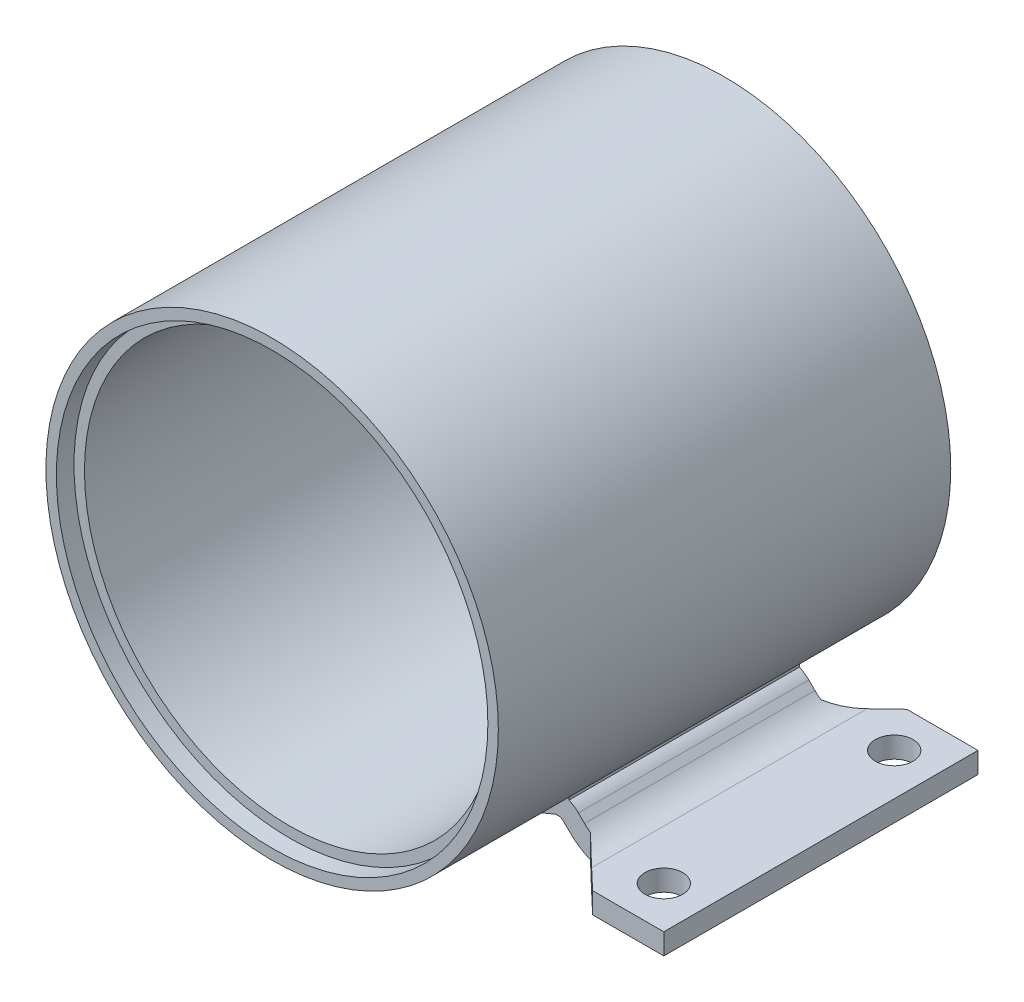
ISO-10303-21;
HEADER;
FILE_DESCRIPTION(('STEP AP214'),'2;1');
FILE_NAME('part.step','',(''),(''),'','','');
FILE_SCHEMA(('AUTOMOTIVE_DESIGN { 1 0 10303 214 1 1 1 1 }'));
ENDSEC;
DATA;
#1=APPLICATION_CONTEXT('core data for automotive mechanical design processes');
#2=APPLICATION_PROTOCOL_DEFINITION('international standard','automotive_design',2000,#1);
#3=PRODUCT_CONTEXT('',#1,'mechanical');
#4=PRODUCT('Part','Part','',(#3));
#5=PRODUCT_RELATED_PRODUCT_CATEGORY('part','',(#4));
#6=PRODUCT_DEFINITION_FORMATION('','',#4);
#7=PRODUCT_DEFINITION_CONTEXT('part definition',#1,'design');
#8=PRODUCT_DEFINITION('design','',#6,#7);
#9=PRODUCT_DEFINITION_SHAPE('','',#8);
#10=(LENGTH_UNIT() NAMED_UNIT(*) SI_UNIT(.MILLI.,.METRE.));
#11=(NAMED_UNIT(*) PLANE_ANGLE_UNIT() SI_UNIT($,.RADIAN.));
#12=(NAMED_UNIT(*) SI_UNIT($,.STERADIAN.) SOLID_ANGLE_UNIT());
#13=UNCERTAINTY_MEASURE_WITH_UNIT(LENGTH_MEASURE(1.E-05),#10,'distance_accuracy_value','');
#14=(GEOMETRIC_REPRESENTATION_CONTEXT(3) GLOBAL_UNCERTAINTY_ASSIGNED_CONTEXT((#13)) GLOBAL_UNIT_ASSIGNED_CONTEXT((#10,
#11,#12)) REPRESENTATION_CONTEXT('',''));
#15=CARTESIAN_POINT('',(0.,0.,0.));
#16=DIRECTION('',(0.,0.,1.));
#17=DIRECTION('',(1.,0.,0.));
#18=AXIS2_PLACEMENT_3D('',#15,#16,#17);
#19=CARTESIAN_POINT('',(0.,0.,108.));
#20=DIRECTION('',(0.,0.,-1.));
#21=DIRECTION('',(-1.,0.,0.));
#22=AXIS2_PLACEMENT_3D('',#19,#20,#21);
#23=CYLINDRICAL_SURFACE('',#22,54.);
#24=CARTESIAN_POINT('',(0.,0.,108.));
#25=DIRECTION('',(0.,0.,1.));
#26=DIRECTION('',(1.,0.,0.));
#27=AXIS2_PLACEMENT_3D('',#24,#25,#26);
#28=CIRCLE('',#27,54.);
#29=CARTESIAN_POINT('',(54.,0.,108.));
#30=VERTEX_POINT('',#29);
#31=EDGE_CURVE('E509',#30,#30,#28,.T.);
#32=ORIENTED_EDGE('',*,*,#31,.F.);
#33=EDGE_LOOP('',(#32));
#34=FACE_BOUND('',#33,.T.);
#35=CARTESIAN_POINT('',(0.,0.,0.));
#36=DIRECTION('',(0.,0.,1.));
#37=DIRECTION('',(1.,0.,0.));
#38=AXIS2_PLACEMENT_3D('',#35,#36,#37);
#39=CIRCLE('',#38,54.);
#40=CARTESIAN_POINT('',(-53.9791626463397,-1.5,0.));
#41=VERTEX_POINT('',#40);
#42=CARTESIAN_POINT('',(-53.9791626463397,1.5,0.));
#43=VERTEX_POINT('',#42);
#44=EDGE_CURVE('E507',#41,#43,#39,.T.);
#45=ORIENTED_EDGE('',*,*,#44,.T.);
#46=DIRECTION('',(0.,0.,-1.));
#47=VECTOR('',#46,1.);
#48=CARTESIAN_POINT('',(-53.9791626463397,1.5,108.));
#49=LINE('',#48,#47);
#50=CARTESIAN_POINT('',(-53.9791626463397,1.5,4.2));
#51=VERTEX_POINT('',#50);
#52=EDGE_CURVE('E488',#43,#51,#49,.F.);
#53=ORIENTED_EDGE('',*,*,#52,.T.);
#54=CARTESIAN_POINT('',(0.,0.,4.2));
#55=DIRECTION('',(0.,0.,-1.));
#56=DIRECTION('',(-1.,0.,0.));
#57=AXIS2_PLACEMENT_3D('',#54,#55,#56);
#58=CIRCLE('',#57,54.);
#59=CARTESIAN_POINT('',(-53.9791626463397,-1.5,4.2));
#60=VERTEX_POINT('',#59);
#61=EDGE_CURVE('E491',#60,#51,#58,.T.);
#62=ORIENTED_EDGE('',*,*,#61,.F.);
#63=DIRECTION('',(0.,0.,-1.));
#64=VECTOR('',#63,1.);
#65=CARTESIAN_POINT('',(-53.9791626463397,-1.5,108.));
#66=LINE('',#65,#64);
#67=EDGE_CURVE('E482',#60,#41,#66,.T.);
#68=ORIENTED_EDGE('',*,*,#67,.T.);
#69=EDGE_LOOP('',(#45,#53,#62,#68));
#70=FACE_BOUND('',#69,.T.);
#71=DIRECTION('',(0.,0.,-1.));
#72=VECTOR('',#71,1.);
#73=CARTESIAN_POINT('',(27.8579742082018,-46.2594128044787,71.3018990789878));
#74=LINE('',#73,#72);
#75=CARTESIAN_POINT('',(27.8579742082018,-46.2594128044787,65.));
#76=VERTEX_POINT('',#75);
#77=CARTESIAN_POINT('',(27.8579742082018,-46.2594128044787,10.));
#78=VERTEX_POINT('',#77);
#79=EDGE_CURVE('E276',#76,#78,#74,.T.);
#80=ORIENTED_EDGE('',*,*,#79,.T.);
#81=CARTESIAN_POINT('',(0.,0.,9.99999999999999));
#82=DIRECTION('',(0.,0.,1.));
#83=DIRECTION('',(1.,0.,0.));
#84=AXIS2_PLACEMENT_3D('',#81,#82,#83);
#85=CIRCLE('',#84,54.);
#86=CARTESIAN_POINT('',(-27.8579742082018,-46.2594128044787,10.));
#87=VERTEX_POINT('',#86);
#88=EDGE_CURVE('E259',#78,#87,#85,.F.);
#89=ORIENTED_EDGE('',*,*,#88,.T.);
#90=DIRECTION('',(0.,0.,-1.));
#91=VECTOR('',#90,1.);
#92=CARTESIAN_POINT('',(-27.8579742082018,-46.2594128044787,71.3018990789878));
#93=LINE('',#92,#91);
#94=CARTESIAN_POINT('',(-27.8579742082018,-46.2594128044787,65.));
#95=VERTEX_POINT('',#94);
#96=EDGE_CURVE('E289',#95,#87,#93,.T.);
#97=ORIENTED_EDGE('',*,*,#96,.F.);
#98=CARTESIAN_POINT('',(0.,0.,65.));
#99=DIRECTION('',(0.,0.,-1.));
#100=DIRECTION('',(-1.,0.,0.));
#101=AXIS2_PLACEMENT_3D('',#98,#99,#100);
#102=CIRCLE('',#101,54.);
#103=EDGE_CURVE('E281',#95,#76,#102,.F.);
#104=ORIENTED_EDGE('',*,*,#103,.T.);
#105=EDGE_LOOP('',(#80,#89,#97,#104));
#106=FACE_BOUND('',#105,.T.);
#107=ADVANCED_FACE('F38',(#34,#70,#106),#23,.T.);
#108=CARTESIAN_POINT('',(38.642135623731,-45.,75.));
#109=DIRECTION('',(0.,0.,1.));
#110=DIRECTION('',(1.,0.,0.));
#111=AXIS2_PLACEMENT_3D('',#108,#109,#110);
#112=PLANE('',#111);
#113=DIRECTION('',(0.,-1.,0.));
#114=VECTOR('',#113,1.);
#115=CARTESIAN_POINT('',(-43.5,-45.,75.));
#116=LINE('',#115,#114);
#117=CARTESIAN_POINT('',(-43.5,-55.,75.));
#118=VERTEX_POINT('',#117);
#119=CARTESIAN_POINT('',(-43.5,-60.,75.));
#120=VERTEX_POINT('',#119);
#121=EDGE_CURVE('E45',#118,#120,#116,.T.);
#122=ORIENTED_EDGE('',*,*,#121,.F.);
#123=DIRECTION('',(1.,0.,0.));
#124=VECTOR('',#123,1.);
#125=CARTESIAN_POINT('',(-60.5,-55.,75.));
#126=LINE('',#125,#124);
#127=CARTESIAN_POINT('',(-60.5,-55.,75.));
#128=VERTEX_POINT('',#127);
#129=EDGE_CURVE('E425',#128,#118,#126,.T.);
#130=ORIENTED_EDGE('',*,*,#129,.F.);
#131=DIRECTION('',(0.,1.,0.));
#132=VECTOR('',#131,1.);
#133=CARTESIAN_POINT('',(-60.5,-60.,75.));
#134=LINE('',#133,#132);
#135=CARTESIAN_POINT('',(-60.5,-60.,75.));
#136=VERTEX_POINT('',#135);
#137=EDGE_CURVE('E422',#136,#128,#134,.T.);
#138=ORIENTED_EDGE('',*,*,#137,.F.);
#139=DIRECTION('',(-1.,0.,0.));
#140=VECTOR('',#139,1.);
#141=CARTESIAN_POINT('',(-60.5,-60.,75.));
#142=LINE('',#141,#140);
#143=EDGE_CURVE('E420',#120,#136,#142,.T.);
#144=ORIENTED_EDGE('',*,*,#143,.F.);
#145=EDGE_LOOP('',(#122,#130,#138,#144));
#146=FACE_BOUND('',#145,.T.);
#147=ADVANCED_FACE('F538',(#146),#112,.T.);
#148=CARTESIAN_POINT('',(0.,0.,0.));
#149=DIRECTION('',(0.,0.,1.));
#150=DIRECTION('',(1.,0.,0.));
#151=AXIS2_PLACEMENT_3D('',#148,#149,#150);
#152=PLANE('',#151);
#153=DIRECTION('',(-1.,0.,0.));
#154=VECTOR('',#153,1.);
#155=CARTESIAN_POINT('',(60.5,-60.,0.));
#156=LINE('',#155,#154);
#157=CARTESIAN_POINT('',(60.5,-60.,0.));
#158=VERTEX_POINT('',#157);
#159=CARTESIAN_POINT('',(43.5,-60.,0.));
#160=VERTEX_POINT('',#159);
#161=EDGE_CURVE('E400',#158,#160,#156,.T.);
#162=ORIENTED_EDGE('',*,*,#161,.T.);
#163=DIRECTION('',(0.,-1.,0.));
#164=VECTOR('',#163,1.);
#165=CARTESIAN_POINT('',(43.5,54.001,0.));
#166=LINE('',#165,#164);
#167=CARTESIAN_POINT('',(43.5,-55.,0.));
#168=VERTEX_POINT('',#167);
#169=EDGE_CURVE('E60',#168,#160,#166,.T.);
#170=ORIENTED_EDGE('',*,*,#169,.F.);
#171=DIRECTION('',(1.,0.,0.));
#172=VECTOR('',#171,1.);
#173=CARTESIAN_POINT('',(60.5,-55.,0.));
#174=LINE('',#173,#172);
#175=CARTESIAN_POINT('',(60.5,-55.,0.));
#176=VERTEX_POINT('',#175);
#177=EDGE_CURVE('E412',#168,#176,#174,.T.);
#178=ORIENTED_EDGE('',*,*,#177,.T.);
#179=DIRECTION('',(0.,-1.,0.));
#180=VECTOR('',#179,1.);
#181=CARTESIAN_POINT('',(60.5,-60.,0.));
#182=LINE('',#181,#180);
#183=EDGE_CURVE('E397',#176,#158,#182,.T.);
#184=ORIENTED_EDGE('',*,*,#183,.T.);
#185=EDGE_LOOP('',(#162,#170,#178,#184));
#186=FACE_BOUND('',#185,.T.);
#187=ADVANCED_FACE('F597',(#186),#152,.F.);
#188=DIRECTION('',(1.,0.,0.));
#189=VECTOR('',#188,1.);
#190=CARTESIAN_POINT('',(-60.5,-55.,0.));
#191=LINE('',#190,#189);
#192=CARTESIAN_POINT('',(-60.5,-55.,0.));
#193=VERTEX_POINT('',#192);
#194=CARTESIAN_POINT('',(-43.5,-55.,0.));
#195=VERTEX_POINT('',#194);
#196=EDGE_CURVE('E408',#193,#195,#191,.T.);
#197=ORIENTED_EDGE('',*,*,#196,.T.);
#198=DIRECTION('',(0.,-1.,0.));
#199=VECTOR('',#198,1.);
#200=CARTESIAN_POINT('',(-43.5,54.001,0.));
#201=LINE('',#200,#199);
#202=CARTESIAN_POINT('',(-43.5,-60.,0.));
#203=VERTEX_POINT('',#202);
#204=EDGE_CURVE('E271',#195,#203,#201,.T.);
#205=ORIENTED_EDGE('',*,*,#204,.T.);
#206=DIRECTION('',(-1.,0.,0.));
#207=VECTOR('',#206,1.);
#208=CARTESIAN_POINT('',(-60.5,-60.,0.));
#209=LINE('',#208,#207);
#210=CARTESIAN_POINT('',(-60.5,-60.,0.));
#211=VERTEX_POINT('',#210);
#212=EDGE_CURVE('E403',#203,#211,#209,.T.);
#213=ORIENTED_EDGE('',*,*,#212,.T.);
#214=DIRECTION('',(0.,1.,0.));
#215=VECTOR('',#214,1.);
#216=CARTESIAN_POINT('',(-60.5,-60.,0.));
#217=LINE('',#216,#215);
#218=EDGE_CURVE('E405',#211,#193,#217,.T.);
#219=ORIENTED_EDGE('',*,*,#218,.T.);
#220=EDGE_LOOP('',(#197,#205,#213,#219));
#221=FACE_BOUND('',#220,.T.);
#222=ADVANCED_FACE('F545',(#221),#152,.F.);
#223=CARTESIAN_POINT('',(0.,0.,108.));
#224=DIRECTION('',(0.,0.,-1.));
#225=DIRECTION('',(-1.,0.,0.));
#226=AXIS2_PLACEMENT_3D('',#223,#224,#225);
#227=CYLINDRICAL_SURFACE('',#226,49.);
#228=CARTESIAN_POINT('',(0.,0.,103.8));
#229=DIRECTION('',(0.,0.,1.));
#230=DIRECTION('',(1.,0.,0.));
#231=AXIS2_PLACEMENT_3D('',#228,#229,#230);
#232=CIRCLE('',#231,49.);
#233=CARTESIAN_POINT('',(49.,0.,103.8));
#234=VERTEX_POINT('',#233);
#235=EDGE_CURVE('E506',#234,#234,#232,.T.);
#236=ORIENTED_EDGE('',*,*,#235,.T.);
#237=EDGE_LOOP('',(#236));
#238=FACE_BOUND('',#237,.T.);
#239=CARTESIAN_POINT('',(0.,0.,4.2));
#240=DIRECTION('',(0.,0.,-1.));
#241=DIRECTION('',(-1.,0.,0.));
#242=AXIS2_PLACEMENT_3D('',#239,#240,#241);
#243=CIRCLE('',#242,49.);
#244=CARTESIAN_POINT('',(-49.,0.,4.2));
#245=VERTEX_POINT('',#244);
#246=EDGE_CURVE('E499',#245,#245,#243,.T.);
#247=ORIENTED_EDGE('',*,*,#246,.T.);
#248=EDGE_LOOP('',(#247));
#249=FACE_BOUND('',#248,.T.);
#250=ADVANCED_FACE('F646',(#238,#249),#227,.F.);
#251=CARTESIAN_POINT('',(0.,0.,108.));
#252=DIRECTION('',(0.,0.,1.));
#253=DIRECTION('',(1.,0.,0.));
#254=AXIS2_PLACEMENT_3D('',#251,#252,#253);
#255=PLANE('',#254);
#256=CARTESIAN_POINT('',(0.,0.,108.));
#257=DIRECTION('',(0.,0.,1.));
#258=DIRECTION('',(1.,0.,0.));
#259=AXIS2_PLACEMENT_3D('',#256,#257,#258);
#260=CIRCLE('',#259,51.5);
#261=CARTESIAN_POINT('',(51.5,0.,108.));
#262=VERTEX_POINT('',#261);
#263=EDGE_CURVE('E500',#262,#262,#260,.T.);
#264=ORIENTED_EDGE('',*,*,#263,.F.);
#265=EDGE_LOOP('',(#264));
#266=FACE_BOUND('',#265,.T.);
#267=ORIENTED_EDGE('',*,*,#31,.T.);
#268=EDGE_LOOP('',(#267));
#269=FACE_BOUND('',#268,.T.);
#270=ADVANCED_FACE('F649',(#266,#269),#255,.T.);
#271=DIRECTION('',(1.,0.,0.));
#272=VECTOR('',#271,1.);
#273=CARTESIAN_POINT('',(-44.6778711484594,1.5,0.));
#274=LINE('',#273,#272);
#275=CARTESIAN_POINT('',(-51.478150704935,1.5,0.));
#276=VERTEX_POINT('',#275);
#277=EDGE_CURVE('E475',#43,#276,#274,.T.);
#278=ORIENTED_EDGE('',*,*,#277,.F.);
#279=ORIENTED_EDGE('',*,*,#44,.F.);
#280=DIRECTION('',(-1.,0.,0.));
#281=VECTOR('',#280,1.);
#282=CARTESIAN_POINT('',(-44.6778711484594,-1.5,0.));
#283=LINE('',#282,#281);
#284=CARTESIAN_POINT('',(-51.478150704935,-1.5,0.));
#285=VERTEX_POINT('',#284);
#286=EDGE_CURVE('E434',#285,#41,#283,.T.);
#287=ORIENTED_EDGE('',*,*,#286,.F.);
#288=CARTESIAN_POINT('',(0.,0.,0.));
#289=DIRECTION('',(0.,0.,-1.));
#290=DIRECTION('',(-1.,0.,0.));
#291=AXIS2_PLACEMENT_3D('',#288,#289,#290);
#292=CIRCLE('',#291,51.5);
#293=EDGE_CURVE('E493',#276,#285,#292,.T.);
#294=ORIENTED_EDGE('',*,*,#293,.F.);
#295=EDGE_LOOP('',(#278,#279,#287,#294));
#296=FACE_BOUND('',#295,.T.);
#297=ADVANCED_FACE('F612',(#296),#152,.F.);
#298=CARTESIAN_POINT('',(0.,0.,103.8));
#299=DIRECTION('',(0.,0.,1.));
#300=DIRECTION('',(1.,0.,0.));
#301=AXIS2_PLACEMENT_3D('',#298,#299,#300);
#302=CYLINDRICAL_SURFACE('',#301,51.5);
#303=CARTESIAN_POINT('',(0.,0.,103.8));
#304=DIRECTION('',(0.,0.,1.));
#305=DIRECTION('',(1.,0.,0.));
#306=AXIS2_PLACEMENT_3D('',#303,#304,#305);
#307=CIRCLE('',#306,51.5);
#308=CARTESIAN_POINT('',(51.5,0.,103.8));
#309=VERTEX_POINT('',#308);
#310=EDGE_CURVE('E503',#309,#309,#307,.T.);
#311=ORIENTED_EDGE('',*,*,#310,.F.);
#312=EDGE_LOOP('',(#311));
#313=FACE_BOUND('',#312,.T.);
#314=ORIENTED_EDGE('',*,*,#263,.T.);
#315=EDGE_LOOP('',(#314));
#316=FACE_BOUND('',#315,.T.);
#317=ADVANCED_FACE('F641',(#313,#316),#302,.F.);
#318=CARTESIAN_POINT('',(0.,0.,103.8));
#319=DIRECTION('',(0.,0.,1.));
#320=DIRECTION('',(1.,0.,0.));
#321=AXIS2_PLACEMENT_3D('',#318,#319,#320);
#322=PLANE('',#321);
#323=ORIENTED_EDGE('',*,*,#235,.F.);
#324=EDGE_LOOP('',(#323));
#325=FACE_BOUND('',#324,.T.);
#326=ORIENTED_EDGE('',*,*,#310,.T.);
#327=EDGE_LOOP('',(#326));
#328=FACE_BOUND('',#327,.T.);
#329=ADVANCED_FACE('F638',(#325,#328),#322,.T.);
#330=CARTESIAN_POINT('',(0.,0.,4.2));
#331=DIRECTION('',(0.,0.,-1.));
#332=DIRECTION('',(-1.,0.,0.));
#333=AXIS2_PLACEMENT_3D('',#330,#331,#332);
#334=CYLINDRICAL_SURFACE('',#333,51.5);
#335=CARTESIAN_POINT('',(0.,0.,4.2));
#336=DIRECTION('',(0.,0.,-1.));
#337=DIRECTION('',(-1.,0.,0.));
#338=AXIS2_PLACEMENT_3D('',#335,#336,#337);
#339=CIRCLE('',#338,51.5);
#340=CARTESIAN_POINT('',(-51.478150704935,1.5,4.2));
#341=VERTEX_POINT('',#340);
#342=CARTESIAN_POINT('',(-51.478150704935,-1.5,4.2));
#343=VERTEX_POINT('',#342);
#344=EDGE_CURVE('E496',#341,#343,#339,.T.);
#345=ORIENTED_EDGE('',*,*,#344,.F.);
#346=DIRECTION('',(0.,0.,-1.));
#347=VECTOR('',#346,1.);
#348=CARTESIAN_POINT('',(-51.478150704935,1.5,4.2));
#349=LINE('',#348,#347);
#350=EDGE_CURVE('E485',#341,#276,#349,.T.);
#351=ORIENTED_EDGE('',*,*,#350,.T.);
#352=ORIENTED_EDGE('',*,*,#293,.T.);
#353=DIRECTION('',(0.,0.,-1.));
#354=VECTOR('',#353,1.);
#355=CARTESIAN_POINT('',(-51.478150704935,-1.5,4.2));
#356=LINE('',#355,#354);
#357=EDGE_CURVE('E479',#285,#343,#356,.F.);
#358=ORIENTED_EDGE('',*,*,#357,.T.);
#359=EDGE_LOOP('',(#345,#351,#352,#358));
#360=FACE_BOUND('',#359,.T.);
#361=ADVANCED_FACE('F615',(#360),#334,.F.);
#362=CARTESIAN_POINT('',(0.,0.,4.2));
#363=DIRECTION('',(0.,0.,-1.));
#364=DIRECTION('',(-1.,0.,0.));
#365=AXIS2_PLACEMENT_3D('',#362,#363,#364);
#366=PLANE('',#365);
#367=ORIENTED_EDGE('',*,*,#246,.F.);
#368=EDGE_LOOP('',(#367));
#369=FACE_BOUND('',#368,.T.);
#370=ORIENTED_EDGE('',*,*,#344,.T.);
#371=DIRECTION('',(1.,0.,0.));
#372=VECTOR('',#371,1.);
#373=CARTESIAN_POINT('',(-44.6778711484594,-1.5,4.2));
#374=LINE('',#373,#372);
#375=EDGE_CURVE('E474',#60,#343,#374,.T.);
#376=ORIENTED_EDGE('',*,*,#375,.F.);
#377=ORIENTED_EDGE('',*,*,#61,.T.);
#378=DIRECTION('',(-1.,0.,0.));
#379=VECTOR('',#378,1.);
#380=CARTESIAN_POINT('',(-44.6778711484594,1.5,4.2));
#381=LINE('',#380,#379);
#382=EDGE_CURVE('E471',#341,#51,#381,.T.);
#383=ORIENTED_EDGE('',*,*,#382,.F.);
#384=EDGE_LOOP('',(#370,#376,#377,#383));
#385=FACE_BOUND('',#384,.T.);
#386=ADVANCED_FACE('F618',(#369,#385),#366,.T.);
#387=CARTESIAN_POINT('',(-44.6778711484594,1.5,17.9349952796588));
#388=DIRECTION('',(0.,1.,0.));
#389=DIRECTION('',(0.,0.,1.));
#390=AXIS2_PLACEMENT_3D('',#387,#388,#389);
#391=PLANE('',#390);
#392=ORIENTED_EDGE('',*,*,#277,.T.);
#393=ORIENTED_EDGE('',*,*,#350,.F.);
#394=ORIENTED_EDGE('',*,*,#382,.T.);
#395=ORIENTED_EDGE('',*,*,#52,.F.);
#396=EDGE_LOOP('',(#392,#393,#394,#395));
#397=FACE_BOUND('',#396,.T.);
#398=ADVANCED_FACE('F609',(#397),#391,.F.);
#399=CARTESIAN_POINT('',(-44.6778711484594,-1.5,17.9349952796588));
#400=DIRECTION('',(0.,-1.,0.));
#401=DIRECTION('',(0.,0.,-1.));
#402=AXIS2_PLACEMENT_3D('',#399,#400,#401);
#403=PLANE('',#402);
#404=ORIENTED_EDGE('',*,*,#375,.T.);
#405=ORIENTED_EDGE('',*,*,#357,.F.);
#406=ORIENTED_EDGE('',*,*,#286,.T.);
#407=ORIENTED_EDGE('',*,*,#67,.F.);
#408=EDGE_LOOP('',(#404,#405,#406,#407));
#409=FACE_BOUND('',#408,.T.);
#410=ADVANCED_FACE('F620',(#409),#403,.F.);
#411=CARTESIAN_POINT('',(60.5,-60.,75.));
#412=DIRECTION('',(1.,0.,0.));
#413=DIRECTION('',(0.,0.,-1.));
#414=AXIS2_PLACEMENT_3D('',#411,#412,#413);
#415=PLANE('',#414);
#416=ORIENTED_EDGE('',*,*,#183,.F.);
#417=DIRECTION('',(0.,0.,-1.));
#418=VECTOR('',#417,1.);
#419=CARTESIAN_POINT('',(60.5,-55.,75.));
#420=LINE('',#419,#418);
#421=CARTESIAN_POINT('',(60.5,-55.,75.));
#422=VERTEX_POINT('',#421);
#423=EDGE_CURVE('E431',#422,#176,#420,.T.);
#424=ORIENTED_EDGE('',*,*,#423,.F.);
#425=DIRECTION('',(0.,-1.,0.));
#426=VECTOR('',#425,1.);
#427=CARTESIAN_POINT('',(60.5,-60.,75.));
#428=LINE('',#427,#426);
#429=CARTESIAN_POINT('',(60.5,-60.,75.));
#430=VERTEX_POINT('',#429);
#431=EDGE_CURVE('E414',#422,#430,#428,.T.);
#432=ORIENTED_EDGE('',*,*,#431,.T.);
#433=DIRECTION('',(0.,0.,-1.));
#434=VECTOR('',#433,1.);
#435=CARTESIAN_POINT('',(60.5,-60.,75.));
#436=LINE('',#435,#434);
#437=EDGE_CURVE('E430',#430,#158,#436,.T.);
#438=ORIENTED_EDGE('',*,*,#437,.T.);
#439=EDGE_LOOP('',(#416,#424,#432,#438));
#440=FACE_BOUND('',#439,.T.);
#441=ADVANCED_FACE('F622',(#440),#415,.T.);
#442=CARTESIAN_POINT('',(60.5,-55.,75.));
#443=DIRECTION('',(0.,1.,0.));
#444=DIRECTION('',(0.,0.,1.));
#445=AXIS2_PLACEMENT_3D('',#442,#443,#444);
#446=PLANE('',#445);
#447=CARTESIAN_POINT('',(50.5,-55.,65.));
#448=DIRECTION('',(0.,-1.,0.));
#449=DIRECTION('',(1.,0.,0.));
#450=AXIS2_PLACEMENT_3D('',#447,#448,#449);
#451=CIRCLE('',#450,4.5);
#452=CARTESIAN_POINT('',(55.,-55.,65.));
#453=VERTEX_POINT('',#452);
#454=EDGE_CURVE('E987',#453,#453,#451,.T.);
#455=ORIENTED_EDGE('',*,*,#454,.T.);
#456=EDGE_LOOP('',(#455));
#457=FACE_BOUND('',#456,.T.);
#458=CARTESIAN_POINT('',(50.5,-55.,10.));
#459=DIRECTION('',(0.,-1.,0.));
#460=DIRECTION('',(1.,0.,0.));
#461=AXIS2_PLACEMENT_3D('',#458,#459,#460);
#462=CIRCLE('',#461,4.5);
#463=CARTESIAN_POINT('',(55.,-55.,10.));
#464=VERTEX_POINT('',#463);
#465=EDGE_CURVE('E279',#464,#464,#462,.T.);
#466=ORIENTED_EDGE('',*,*,#465,.T.);
#467=EDGE_LOOP('',(#466));
#468=FACE_BOUND('',#467,.T.);
#469=DIRECTION('',(-0.724137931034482,0.,-0.689655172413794));
#470=VECTOR('',#469,1.);
#471=CARTESIAN_POINT('',(52.4143876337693,-55.,83.4898929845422));
#472=LINE('',#471,#470);
#473=CARTESIAN_POINT('',(43.5,-55.,75.));
#474=VERTEX_POINT('',#473);
#475=CARTESIAN_POINT('',(38.642135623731,-55.,70.3734624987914));
#476=VERTEX_POINT('',#475);
#477=EDGE_CURVE('E308',#474,#476,#472,.T.);
#478=ORIENTED_EDGE('',*,*,#477,.F.);
#479=DIRECTION('',(1.,0.,0.));
#480=VECTOR('',#479,1.);
#481=CARTESIAN_POINT('',(60.5,-55.,75.));
#482=LINE('',#481,#480);
#483=EDGE_CURVE('E428',#474,#422,#482,.T.);
#484=ORIENTED_EDGE('',*,*,#483,.T.);
#485=ORIENTED_EDGE('',*,*,#423,.T.);
#486=ORIENTED_EDGE('',*,*,#177,.F.);
#487=DIRECTION('',(0.724137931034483,0.,-0.689655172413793));
#488=VECTOR('',#487,1.);
#489=CARTESIAN_POINT('',(14.9589774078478,-55.,27.1819262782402));
#490=LINE('',#489,#488);
#491=CARTESIAN_POINT('',(38.642135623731,-55.,4.6265375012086));
#492=VERTEX_POINT('',#491);
#493=EDGE_CURVE('E358',#492,#168,#490,.T.);
#494=ORIENTED_EDGE('',*,*,#493,.F.);
#495=DIRECTION('',(0.,0.,-1.));
#496=VECTOR('',#495,1.);
#497=CARTESIAN_POINT('',(38.642135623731,-55.,75.));
#498=LINE('',#497,#496);
#499=EDGE_CURVE('E435',#476,#492,#498,.T.);
#500=ORIENTED_EDGE('',*,*,#499,.F.);
#501=EDGE_LOOP('',(#478,#484,#485,#486,#494,#500));
#502=FACE_BOUND('',#501,.T.);
#503=ADVANCED_FACE('F628',(#457,#468,#502),#446,.T.);
#504=CARTESIAN_POINT('',(38.642135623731,-45.,75.));
#505=DIRECTION('',(0.,0.,-1.));
#506=DIRECTION('',(-1.,0.,0.));
#507=AXIS2_PLACEMENT_3D('',#504,#505,#506);
#508=CYLINDRICAL_SURFACE('',#507,10.);
#509=CARTESIAN_POINT('',(38.642135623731,-45.,65.));
#510=DIRECTION('',(0.,0.,-1.));
#511=DIRECTION('',(-1.,0.,0.));
#512=AXIS2_PLACEMENT_3D('',#509,#510,#511);
#513=CIRCLE('',#512,10.);
#514=CARTESIAN_POINT('',(33.,-53.2562888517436,65.));
#515=VERTEX_POINT('',#514);
#516=CARTESIAN_POINT('',(31.5710678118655,-52.0710678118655,65.));
#517=VERTEX_POINT('',#516);
#518=EDGE_CURVE('E339',#515,#517,#513,.T.);
#519=ORIENTED_EDGE('',*,*,#518,.F.);
#520=CARTESIAN_POINT('',(38.642135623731,-45.,70.3734624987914));
#521=DIRECTION('',(0.689655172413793,0.,-0.724137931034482));
#522=DIRECTION('',(-0.724137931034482,0.,-0.689655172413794));
#523=AXIS2_PLACEMENT_3D('',#520,#521,#522);
#524=ELLIPSE('',#523,13.8095238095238,10.);
#525=EDGE_CURVE('E306',#476,#515,#524,.T.);
#526=ORIENTED_EDGE('',*,*,#525,.F.);
#527=ORIENTED_EDGE('',*,*,#499,.T.);
#528=CARTESIAN_POINT('',(38.642135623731,-45.,4.62653750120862));
#529=DIRECTION('',(0.689655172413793,0.,0.724137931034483));
#530=DIRECTION('',(0.724137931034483,0.,-0.689655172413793));
#531=AXIS2_PLACEMENT_3D('',#528,#529,#530);
#532=ELLIPSE('',#531,13.8095238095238,10.);
#533=CARTESIAN_POINT('',(33.,-53.2562888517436,9.99999999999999));
#534=VERTEX_POINT('',#533);
#535=EDGE_CURVE('E355',#534,#492,#532,.T.);
#536=ORIENTED_EDGE('',*,*,#535,.F.);
#537=CARTESIAN_POINT('',(38.642135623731,-45.,9.99999999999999));
#538=DIRECTION('',(0.,0.,1.));
#539=DIRECTION('',(1.,0.,0.));
#540=AXIS2_PLACEMENT_3D('',#537,#538,#539);
#541=CIRCLE('',#540,10.);
#542=CARTESIAN_POINT('',(31.5710678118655,-52.0710678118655,9.99999999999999));
#543=VERTEX_POINT('',#542);
#544=EDGE_CURVE('E390',#543,#534,#541,.T.);
#545=ORIENTED_EDGE('',*,*,#544,.F.);
#546=DIRECTION('',(0.,0.,-1.));
#547=VECTOR('',#546,1.);
#548=CARTESIAN_POINT('',(31.5710678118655,-52.0710678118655,75.));
#549=LINE('',#548,#547);
#550=EDGE_CURVE('E437',#517,#543,#549,.T.);
#551=ORIENTED_EDGE('',*,*,#550,.F.);
#552=EDGE_LOOP('',(#519,#526,#527,#536,#545,#551));
#553=FACE_BOUND('',#552,.T.);
#554=ADVANCED_FACE('F848',(#553),#508,.F.);
#555=CARTESIAN_POINT('',(31.5710678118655,-52.0710678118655,75.));
#556=DIRECTION('',(0.707106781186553,0.707106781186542,0.));
#557=DIRECTION('',(-0.707106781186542,0.707106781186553,0.));
#558=AXIS2_PLACEMENT_3D('',#555,#556,#557);
#559=PLANE('',#558);
#560=DIRECTION('',(-0.707106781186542,0.707106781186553,0.));
#561=VECTOR('',#560,1.);
#562=CARTESIAN_POINT('',(31.5710678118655,-52.0710678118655,65.));
#563=LINE('',#562,#561);
#564=CARTESIAN_POINT('',(30.116665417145,-50.616665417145,65.));
#565=VERTEX_POINT('',#564);
#566=EDGE_CURVE('E337',#517,#565,#563,.T.);
#567=ORIENTED_EDGE('',*,*,#566,.F.);
#568=ORIENTED_EDGE('',*,*,#550,.T.);
#569=DIRECTION('',(0.707106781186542,-0.707106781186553,0.));
#570=VECTOR('',#569,1.);
#571=CARTESIAN_POINT('',(31.5710678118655,-52.0710678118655,9.99999999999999));
#572=LINE('',#571,#570);
#573=CARTESIAN_POINT('',(30.116665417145,-50.616665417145,9.99999999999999));
#574=VERTEX_POINT('',#573);
#575=EDGE_CURVE('E387',#574,#543,#572,.T.);
#576=ORIENTED_EDGE('',*,*,#575,.F.);
#577=DIRECTION('',(0.,0.,-1.));
#578=VECTOR('',#577,1.);
#579=CARTESIAN_POINT('',(30.116665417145,-50.616665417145,75.));
#580=LINE('',#579,#578);
#581=EDGE_CURVE('E439',#565,#574,#580,.T.);
#582=ORIENTED_EDGE('',*,*,#581,.F.);
#583=EDGE_LOOP('',(#567,#568,#576,#582));
#584=FACE_BOUND('',#583,.T.);
#585=ADVANCED_FACE('F824',(#584),#559,.T.);
#586=CARTESIAN_POINT('',(25.1669179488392,-55.5664128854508,75.));
#587=DIRECTION('',(0.,0.,-1.));
#588=DIRECTION('',(-1.,0.,0.));
#589=AXIS2_PLACEMENT_3D('',#586,#587,#588);
#590=CYLINDRICAL_SURFACE('',#589,7.00000000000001);
#591=DIRECTION('',(0.,0.,-1.));
#592=VECTOR('',#591,1.);
#593=CARTESIAN_POINT('',(27.8579742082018,-49.1043531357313,71.3018990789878));
#594=LINE('',#593,#592);
#595=CARTESIAN_POINT('',(27.8579742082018,-49.1043531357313,65.));
#596=VERTEX_POINT('',#595);
#597=CARTESIAN_POINT('',(27.8579742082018,-49.1043531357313,10.));
#598=VERTEX_POINT('',#597);
#599=EDGE_CURVE('E278',#596,#598,#594,.T.);
#600=ORIENTED_EDGE('',*,*,#599,.F.);
#601=CARTESIAN_POINT('',(25.1669179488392,-55.5664128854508,65.));
#602=DIRECTION('',(0.,0.,-1.));
#603=DIRECTION('',(-1.,0.,0.));
#604=AXIS2_PLACEMENT_3D('',#601,#602,#603);
#605=CIRCLE('',#604,7.00000000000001);
#606=EDGE_CURVE('E334',#565,#596,#605,.F.);
#607=ORIENTED_EDGE('',*,*,#606,.F.);
#608=ORIENTED_EDGE('',*,*,#581,.T.);
#609=CARTESIAN_POINT('',(25.1669179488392,-55.5664128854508,9.99999999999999));
#610=DIRECTION('',(0.,0.,1.));
#611=DIRECTION('',(1.,0.,0.));
#612=AXIS2_PLACEMENT_3D('',#609,#610,#611);
#613=CIRCLE('',#612,7.00000000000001);
#614=EDGE_CURVE('E385',#598,#574,#613,.F.);
#615=ORIENTED_EDGE('',*,*,#614,.F.);
#616=EDGE_LOOP('',(#600,#607,#608,#615));
#617=FACE_BOUND('',#616,.T.);
#618=ADVANCED_FACE('F820',(#617),#590,.T.);
#619=CARTESIAN_POINT('',(-25.1669179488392,-55.5664128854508,75.));
#620=DIRECTION('',(0.,0.,-1.));
#621=DIRECTION('',(-1.,0.,0.));
#622=AXIS2_PLACEMENT_3D('',#619,#620,#621);
#623=CYLINDRICAL_SURFACE('',#622,7.);
#624=DIRECTION('',(0.,0.,-1.));
#625=VECTOR('',#624,1.);
#626=CARTESIAN_POINT('',(-27.8579742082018,-49.1043531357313,71.3018990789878));
#627=LINE('',#626,#625);
#628=CARTESIAN_POINT('',(-27.8579742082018,-49.1043531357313,65.));
#629=VERTEX_POINT('',#628);
#630=CARTESIAN_POINT('',(-27.8579742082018,-49.1043531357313,10.));
#631=VERTEX_POINT('',#630);
#632=EDGE_CURVE('E52',#629,#631,#627,.T.);
#633=ORIENTED_EDGE('',*,*,#632,.T.);
#634=CARTESIAN_POINT('',(-25.1669179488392,-55.5664128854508,9.99999999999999));
#635=DIRECTION('',(0.,0.,1.));
#636=DIRECTION('',(1.,0.,0.));
#637=AXIS2_PLACEMENT_3D('',#634,#635,#636);
#638=CIRCLE('',#637,7.);
#639=CARTESIAN_POINT('',(-30.116665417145,-50.616665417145,9.99999999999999));
#640=VERTEX_POINT('',#639);
#641=EDGE_CURVE('E383',#640,#631,#638,.F.);
#642=ORIENTED_EDGE('',*,*,#641,.F.);
#643=DIRECTION('',(0.,0.,-1.));
#644=VECTOR('',#643,1.);
#645=CARTESIAN_POINT('',(-30.116665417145,-50.616665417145,75.));
#646=LINE('',#645,#644);
#647=CARTESIAN_POINT('',(-30.116665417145,-50.616665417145,65.));
#648=VERTEX_POINT('',#647);
#649=EDGE_CURVE('E442',#648,#640,#646,.T.);
#650=ORIENTED_EDGE('',*,*,#649,.F.);
#651=CARTESIAN_POINT('',(-25.1669179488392,-55.5664128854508,65.));
#652=DIRECTION('',(0.,0.,-1.));
#653=DIRECTION('',(-1.,0.,0.));
#654=AXIS2_PLACEMENT_3D('',#651,#652,#653);
#655=CIRCLE('',#654,7.);
#656=EDGE_CURVE('E332',#629,#648,#655,.F.);
#657=ORIENTED_EDGE('',*,*,#656,.F.);
#658=EDGE_LOOP('',(#633,#642,#650,#657));
#659=FACE_BOUND('',#658,.T.);
#660=ADVANCED_FACE('F578',(#659),#623,.T.);
#661=CARTESIAN_POINT('',(-31.5710678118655,-52.0710678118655,75.));
#662=DIRECTION('',(-0.707106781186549,0.707106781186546,0.));
#663=DIRECTION('',(-0.707106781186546,-0.707106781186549,0.));
#664=AXIS2_PLACEMENT_3D('',#661,#662,#663);
#665=PLANE('',#664);
#666=DIRECTION('',(-0.707106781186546,-0.707106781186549,0.));
#667=VECTOR('',#666,1.);
#668=CARTESIAN_POINT('',(-31.5710678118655,-52.0710678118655,65.));
#669=LINE('',#668,#667);
#670=CARTESIAN_POINT('',(-31.5710678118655,-52.0710678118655,65.));
#671=VERTEX_POINT('',#670);
#672=EDGE_CURVE('E330',#648,#671,#669,.T.);
#673=ORIENTED_EDGE('',*,*,#672,.F.);
#674=ORIENTED_EDGE('',*,*,#649,.T.);
#675=DIRECTION('',(0.707106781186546,0.707106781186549,0.));
#676=VECTOR('',#675,1.);
#677=CARTESIAN_POINT('',(-31.5710678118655,-52.0710678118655,9.99999999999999));
#678=LINE('',#677,#676);
#679=CARTESIAN_POINT('',(-31.5710678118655,-52.0710678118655,9.99999999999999));
#680=VERTEX_POINT('',#679);
#681=EDGE_CURVE('E380',#680,#640,#678,.T.);
#682=ORIENTED_EDGE('',*,*,#681,.F.);
#683=DIRECTION('',(0.,0.,-1.));
#684=VECTOR('',#683,1.);
#685=CARTESIAN_POINT('',(-31.5710678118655,-52.0710678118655,75.));
#686=LINE('',#685,#684);
#687=EDGE_CURVE('E444',#671,#680,#686,.T.);
#688=ORIENTED_EDGE('',*,*,#687,.F.);
#689=EDGE_LOOP('',(#673,#674,#682,#688));
#690=FACE_BOUND('',#689,.T.);
#691=ADVANCED_FACE('F574',(#690),#665,.T.);
#692=CARTESIAN_POINT('',(-38.642135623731,-45.,75.));
#693=DIRECTION('',(0.,0.,-1.));
#694=DIRECTION('',(-1.,0.,0.));
#695=AXIS2_PLACEMENT_3D('',#692,#693,#694);
#696=CYLINDRICAL_SURFACE('',#695,10.);
#697=CARTESIAN_POINT('',(-38.642135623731,-45.,65.));
#698=DIRECTION('',(0.,0.,-1.));
#699=DIRECTION('',(-1.,0.,0.));
#700=AXIS2_PLACEMENT_3D('',#697,#698,#699);
#701=CIRCLE('',#700,10.);
#702=CARTESIAN_POINT('',(-33.,-53.2562888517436,65.));
#703=VERTEX_POINT('',#702);
#704=EDGE_CURVE('E328',#671,#703,#701,.T.);
#705=ORIENTED_EDGE('',*,*,#704,.F.);
#706=ORIENTED_EDGE('',*,*,#687,.T.);
#707=CARTESIAN_POINT('',(-38.642135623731,-45.,9.99999999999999));
#708=DIRECTION('',(0.,0.,1.));
#709=DIRECTION('',(1.,0.,0.));
#710=AXIS2_PLACEMENT_3D('',#707,#708,#709);
#711=CIRCLE('',#710,10.);
#712=CARTESIAN_POINT('',(-33.,-53.2562888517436,9.99999999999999));
#713=VERTEX_POINT('',#712);
#714=EDGE_CURVE('E377',#713,#680,#711,.T.);
#715=ORIENTED_EDGE('',*,*,#714,.F.);
#716=CARTESIAN_POINT('',(-38.642135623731,-45.,4.62653750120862));
#717=DIRECTION('',(-0.689655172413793,0.,0.724137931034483));
#718=DIRECTION('',(-0.724137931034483,0.,-0.689655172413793));
#719=AXIS2_PLACEMENT_3D('',#716,#717,#718);
#720=ELLIPSE('',#719,13.8095238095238,10.);
#721=CARTESIAN_POINT('',(-38.642135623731,-55.,4.62653750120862));
#722=VERTEX_POINT('',#721);
#723=EDGE_CURVE('E395',#722,#713,#720,.T.);
#724=ORIENTED_EDGE('',*,*,#723,.F.);
#725=DIRECTION('',(0.,0.,-1.));
#726=VECTOR('',#725,1.);
#727=CARTESIAN_POINT('',(-38.642135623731,-55.,75.));
#728=LINE('',#727,#726);
#729=CARTESIAN_POINT('',(-38.642135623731,-55.,70.3734624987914));
#730=VERTEX_POINT('',#729);
#731=EDGE_CURVE('E446',#730,#722,#728,.T.);
#732=ORIENTED_EDGE('',*,*,#731,.F.);
#733=CARTESIAN_POINT('',(-38.642135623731,-45.,70.3734624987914));
#734=DIRECTION('',(-0.689655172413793,0.,-0.724137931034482));
#735=DIRECTION('',(0.724137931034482,0.,-0.689655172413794));
#736=AXIS2_PLACEMENT_3D('',#733,#734,#735);
#737=ELLIPSE('',#736,13.8095238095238,10.);
#738=EDGE_CURVE('E314',#703,#730,#737,.T.);
#739=ORIENTED_EDGE('',*,*,#738,.F.);
#740=EDGE_LOOP('',(#705,#706,#715,#724,#732,#739));
#741=FACE_BOUND('',#740,.T.);
#742=ADVANCED_FACE('F556',(#741),#696,.F.);
#743=CARTESIAN_POINT('',(-60.5,-55.,75.));
#744=DIRECTION('',(0.,1.,0.));
#745=DIRECTION('',(0.,0.,1.));
#746=AXIS2_PLACEMENT_3D('',#743,#744,#745);
#747=PLANE('',#746);
#748=CARTESIAN_POINT('',(-50.5,-55.,65.));
#749=DIRECTION('',(0.,-1.,0.));
#750=DIRECTION('',(1.,0.,0.));
#751=AXIS2_PLACEMENT_3D('',#748,#749,#750);
#752=CIRCLE('',#751,4.5);
#753=CARTESIAN_POINT('',(-46.,-55.,65.));
#754=VERTEX_POINT('',#753);
#755=EDGE_CURVE('E997',#754,#754,#752,.T.);
#756=ORIENTED_EDGE('',*,*,#755,.T.);
#757=EDGE_LOOP('',(#756));
#758=FACE_BOUND('',#757,.T.);
#759=CARTESIAN_POINT('',(-50.5,-55.,9.99999999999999));
#760=DIRECTION('',(0.,-1.,0.));
#761=DIRECTION('',(1.,0.,0.));
#762=AXIS2_PLACEMENT_3D('',#759,#760,#761);
#763=CIRCLE('',#762,4.5);
#764=CARTESIAN_POINT('',(-46.,-55.,9.99999999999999));
#765=VERTEX_POINT('',#764);
#766=EDGE_CURVE('E1003',#765,#765,#763,.T.);
#767=ORIENTED_EDGE('',*,*,#766,.T.);
#768=EDGE_LOOP('',(#767));
#769=FACE_BOUND('',#768,.T.);
#770=DIRECTION('',(-0.724137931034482,0.,0.689655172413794));
#771=VECTOR('',#770,1.);
#772=CARTESIAN_POINT('',(-52.4143876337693,-55.,83.4898929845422));
#773=LINE('',#772,#771);
#774=EDGE_CURVE('E312',#730,#118,#773,.T.);
#775=ORIENTED_EDGE('',*,*,#774,.F.);
#776=ORIENTED_EDGE('',*,*,#731,.T.);
#777=DIRECTION('',(0.724137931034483,0.,0.689655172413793));
#778=VECTOR('',#777,1.);
#779=CARTESIAN_POINT('',(-14.9589774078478,-55.,27.1819262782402));
#780=LINE('',#779,#778);
#781=EDGE_CURVE('E392',#195,#722,#780,.T.);
#782=ORIENTED_EDGE('',*,*,#781,.F.);
#783=ORIENTED_EDGE('',*,*,#196,.F.);
#784=DIRECTION('',(0.,0.,-1.));
#785=VECTOR('',#784,1.);
#786=CARTESIAN_POINT('',(-60.5,-55.,75.));
#787=LINE('',#786,#785);
#788=EDGE_CURVE('E448',#128,#193,#787,.T.);
#789=ORIENTED_EDGE('',*,*,#788,.F.);
#790=ORIENTED_EDGE('',*,*,#129,.T.);
#791=EDGE_LOOP('',(#775,#776,#782,#783,#789,#790));
#792=FACE_BOUND('',#791,.T.);
#793=ADVANCED_FACE('F551',(#758,#769,#792),#747,.T.);
#794=CARTESIAN_POINT('',(-60.5,-60.,75.));
#795=DIRECTION('',(-1.,0.,0.));
#796=DIRECTION('',(0.,0.,1.));
#797=AXIS2_PLACEMENT_3D('',#794,#795,#796);
#798=PLANE('',#797);
#799=ORIENTED_EDGE('',*,*,#218,.F.);
#800=DIRECTION('',(0.,0.,-1.));
#801=VECTOR('',#800,1.);
#802=CARTESIAN_POINT('',(-60.5,-60.,75.));
#803=LINE('',#802,#801);
#804=EDGE_CURVE('E451',#136,#211,#803,.T.);
#805=ORIENTED_EDGE('',*,*,#804,.F.);
#806=ORIENTED_EDGE('',*,*,#137,.T.);
#807=ORIENTED_EDGE('',*,*,#788,.T.);
#808=EDGE_LOOP('',(#799,#805,#806,#807));
#809=FACE_BOUND('',#808,.T.);
#810=ADVANCED_FACE('F541',(#809),#798,.T.);
#811=CARTESIAN_POINT('',(-60.5,-60.,75.));
#812=DIRECTION('',(0.,-1.,0.));
#813=DIRECTION('',(1.,0.,0.));
#814=AXIS2_PLACEMENT_3D('',#811,#812,#813);
#815=PLANE('',#814);
#816=CARTESIAN_POINT('',(-50.5,-60.,65.));
#817=DIRECTION('',(0.,-1.,0.));
#818=DIRECTION('',(1.,0.,0.));
#819=AXIS2_PLACEMENT_3D('',#816,#817,#818);
#820=CIRCLE('',#819,4.5);
#821=CARTESIAN_POINT('',(-46.,-60.,65.));
#822=VERTEX_POINT('',#821);
#823=EDGE_CURVE('E992',#822,#822,#820,.T.);
#824=ORIENTED_EDGE('',*,*,#823,.F.);
#825=EDGE_LOOP('',(#824));
#826=FACE_BOUND('',#825,.T.);
#827=CARTESIAN_POINT('',(-50.5,-60.,9.99999999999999));
#828=DIRECTION('',(0.,-1.,0.));
#829=DIRECTION('',(1.,0.,0.));
#830=AXIS2_PLACEMENT_3D('',#827,#828,#829);
#831=CIRCLE('',#830,4.5);
#832=CARTESIAN_POINT('',(-46.,-60.,9.99999999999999));
#833=VERTEX_POINT('',#832);
#834=EDGE_CURVE('E1000',#833,#833,#831,.T.);
#835=ORIENTED_EDGE('',*,*,#834,.F.);
#836=EDGE_LOOP('',(#835));
#837=FACE_BOUND('',#836,.T.);
#838=DIRECTION('',(0.724137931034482,0.,-0.689655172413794));
#839=VECTOR('',#838,1.);
#840=CARTESIAN_POINT('',(-33.,-60.,65.));
#841=LINE('',#840,#839);
#842=CARTESIAN_POINT('',(-38.642135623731,-60.,70.3734624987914));
#843=VERTEX_POINT('',#842);
#844=EDGE_CURVE('E293',#120,#843,#841,.T.);
#845=ORIENTED_EDGE('',*,*,#844,.F.);
#846=ORIENTED_EDGE('',*,*,#143,.T.);
#847=ORIENTED_EDGE('',*,*,#804,.T.);
#848=ORIENTED_EDGE('',*,*,#212,.F.);
#849=DIRECTION('',(-0.724137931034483,0.,-0.689655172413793));
#850=VECTOR('',#849,1.);
#851=CARTESIAN_POINT('',(-33.,-60.,10.));
#852=LINE('',#851,#850);
#853=CARTESIAN_POINT('',(-38.642135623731,-60.,4.62653750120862));
#854=VERTEX_POINT('',#853);
#855=EDGE_CURVE('E342',#854,#203,#852,.T.);
#856=ORIENTED_EDGE('',*,*,#855,.F.);
#857=DIRECTION('',(0.,0.,-1.));
#858=VECTOR('',#857,1.);
#859=CARTESIAN_POINT('',(-38.642135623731,-60.,75.));
#860=LINE('',#859,#858);
#861=EDGE_CURVE('E454',#843,#854,#860,.T.);
#862=ORIENTED_EDGE('',*,*,#861,.F.);
#863=EDGE_LOOP('',(#845,#846,#847,#848,#856,#862));
#864=FACE_BOUND('',#863,.T.);
#865=ADVANCED_FACE('F534',(#826,#837,#864),#815,.T.);
#866=CARTESIAN_POINT('',(-38.642135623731,-45.,75.));
#867=DIRECTION('',(0.,0.,-1.));
#868=DIRECTION('',(-1.,0.,0.));
#869=AXIS2_PLACEMENT_3D('',#866,#867,#868);
#870=CYLINDRICAL_SURFACE('',#869,15.);
#871=CARTESIAN_POINT('',(-38.642135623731,-45.,65.));
#872=DIRECTION('',(0.,0.,-1.));
#873=DIRECTION('',(-1.,0.,0.));
#874=AXIS2_PLACEMENT_3D('',#871,#872,#873);
#875=CIRCLE('',#874,15.);
#876=CARTESIAN_POINT('',(-33.,-58.8984281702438,65.));
#877=VERTEX_POINT('',#876);
#878=CARTESIAN_POINT('',(-28.0355339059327,-55.6066017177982,65.));
#879=VERTEX_POINT('',#878);
#880=EDGE_CURVE('E326',#877,#879,#875,.F.);
#881=ORIENTED_EDGE('',*,*,#880,.F.);
#882=CARTESIAN_POINT('',(-38.642135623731,-45.,70.3734624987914));
#883=DIRECTION('',(-0.689655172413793,0.,-0.724137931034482));
#884=DIRECTION('',(0.724137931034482,0.,-0.689655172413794));
#885=AXIS2_PLACEMENT_3D('',#882,#883,#884);
#886=ELLIPSE('',#885,20.7142857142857,15.);
#887=EDGE_CURVE('E310',#843,#877,#886,.F.);
#888=ORIENTED_EDGE('',*,*,#887,.F.);
#889=ORIENTED_EDGE('',*,*,#861,.T.);
#890=CARTESIAN_POINT('',(-38.642135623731,-45.,4.62653750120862));
#891=DIRECTION('',(-0.689655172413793,0.,0.724137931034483));
#892=DIRECTION('',(-0.724137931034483,0.,-0.689655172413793));
#893=AXIS2_PLACEMENT_3D('',#890,#891,#892);
#894=ELLIPSE('',#893,20.7142857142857,15.);
#895=CARTESIAN_POINT('',(-33.,-58.8984281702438,9.99999999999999));
#896=VERTEX_POINT('',#895);
#897=EDGE_CURVE('E519',#896,#854,#894,.F.);
#898=ORIENTED_EDGE('',*,*,#897,.F.);
#899=CARTESIAN_POINT('',(-38.642135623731,-45.,9.99999999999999));
#900=DIRECTION('',(0.,0.,1.));
#901=DIRECTION('',(1.,0.,0.));
#902=AXIS2_PLACEMENT_3D('',#899,#900,#901);
#903=CIRCLE('',#902,15.);
#904=CARTESIAN_POINT('',(-28.0355339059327,-55.6066017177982,9.99999999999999));
#905=VERTEX_POINT('',#904);
#906=EDGE_CURVE('E375',#905,#896,#903,.F.);
#907=ORIENTED_EDGE('',*,*,#906,.F.);
#908=DIRECTION('',(0.,0.,-1.));
#909=VECTOR('',#908,1.);
#910=CARTESIAN_POINT('',(-28.0355339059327,-55.6066017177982,75.));
#911=LINE('',#910,#909);
#912=EDGE_CURVE('E456',#879,#905,#911,.T.);
#913=ORIENTED_EDGE('',*,*,#912,.F.);
#914=EDGE_LOOP('',(#881,#888,#889,#898,#907,#913));
#915=FACE_BOUND('',#914,.T.);
#916=ADVANCED_FACE('F566',(#915),#870,.T.);
#917=CARTESIAN_POINT('',(-28.0355339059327,-55.6066017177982,75.));
#918=DIRECTION('',(0.707106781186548,-0.707106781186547,0.));
#919=DIRECTION('',(0.707106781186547,0.707106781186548,0.));
#920=AXIS2_PLACEMENT_3D('',#917,#918,#919);
#921=PLANE('',#920);
#922=DIRECTION('',(0.707106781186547,0.707106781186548,0.));
#923=VECTOR('',#922,1.);
#924=CARTESIAN_POINT('',(-28.0355339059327,-55.6066017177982,65.));
#925=LINE('',#924,#923);
#926=CARTESIAN_POINT('',(-26.5811315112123,-54.1521993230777,65.));
#927=VERTEX_POINT('',#926);
#928=EDGE_CURVE('E324',#879,#927,#925,.T.);
#929=ORIENTED_EDGE('',*,*,#928,.F.);
#930=ORIENTED_EDGE('',*,*,#912,.T.);
#931=DIRECTION('',(-0.707106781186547,-0.707106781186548,0.));
#932=VECTOR('',#931,1.);
#933=CARTESIAN_POINT('',(-28.0355339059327,-55.6066017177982,9.99999999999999));
#934=LINE('',#933,#932);
#935=CARTESIAN_POINT('',(-26.5811315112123,-54.1521993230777,9.99999999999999));
#936=VERTEX_POINT('',#935);
#937=EDGE_CURVE('E372',#936,#905,#934,.T.);
#938=ORIENTED_EDGE('',*,*,#937,.F.);
#939=DIRECTION('',(0.,0.,-1.));
#940=VECTOR('',#939,1.);
#941=CARTESIAN_POINT('',(-26.5811315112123,-54.1521993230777,75.));
#942=LINE('',#941,#940);
#943=EDGE_CURVE('E458',#927,#936,#942,.T.);
#944=ORIENTED_EDGE('',*,*,#943,.F.);
#945=EDGE_LOOP('',(#929,#930,#938,#944));
#946=FACE_BOUND('',#945,.T.);
#947=ADVANCED_FACE('F1059',(#946),#921,.T.);
#948=CARTESIAN_POINT('',(-25.1669179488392,-55.5664128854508,75.));
#949=DIRECTION('',(0.,0.,-1.));
#950=DIRECTION('',(-1.,0.,0.));
#951=AXIS2_PLACEMENT_3D('',#948,#949,#950);
#952=CYLINDRICAL_SURFACE('',#951,2.);
#953=CARTESIAN_POINT('',(-25.1669179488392,-55.5664128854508,65.));
#954=DIRECTION('',(0.,0.,-1.));
#955=DIRECTION('',(-1.,0.,0.));
#956=AXIS2_PLACEMENT_3D('',#953,#954,#955);
#957=CIRCLE('',#956,2.);
#958=CARTESIAN_POINT('',(-24.3417730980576,-53.7445632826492,65.));
#959=VERTEX_POINT('',#958);
#960=EDGE_CURVE('E322',#927,#959,#957,.T.);
#961=ORIENTED_EDGE('',*,*,#960,.F.);
#962=ORIENTED_EDGE('',*,*,#943,.T.);
#963=CARTESIAN_POINT('',(-25.1669179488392,-55.5664128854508,9.99999999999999));
#964=DIRECTION('',(0.,0.,1.));
#965=DIRECTION('',(1.,0.,0.));
#966=AXIS2_PLACEMENT_3D('',#963,#964,#965);
#967=CIRCLE('',#966,2.);
#968=CARTESIAN_POINT('',(-24.3417730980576,-53.7445632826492,9.99999999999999));
#969=VERTEX_POINT('',#968);
#970=EDGE_CURVE('E369',#969,#936,#967,.T.);
#971=ORIENTED_EDGE('',*,*,#970,.F.);
#972=DIRECTION('',(0.,0.,-1.));
#973=VECTOR('',#972,1.);
#974=CARTESIAN_POINT('',(-24.3417730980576,-53.7445632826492,75.));
#975=LINE('',#974,#973);
#976=EDGE_CURVE('E460',#959,#969,#975,.T.);
#977=ORIENTED_EDGE('',*,*,#976,.F.);
#978=EDGE_LOOP('',(#961,#962,#971,#977));
#979=FACE_BOUND('',#978,.T.);
#980=ADVANCED_FACE('F1056',(#979),#952,.F.);
#981=CARTESIAN_POINT('',(0.,0.,75.));
#982=DIRECTION('',(0.,0.,-1.));
#983=DIRECTION('',(-1.,0.,0.));
#984=AXIS2_PLACEMENT_3D('',#981,#982,#983);
#985=CYLINDRICAL_SURFACE('',#984,59.);
#986=CARTESIAN_POINT('',(0.,0.,65.));
#987=DIRECTION('',(0.,0.,-1.));
#988=DIRECTION('',(-1.,0.,0.));
#989=AXIS2_PLACEMENT_3D('',#986,#987,#988);
#990=CIRCLE('',#989,59.);
#991=CARTESIAN_POINT('',(24.3417730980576,-53.7445632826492,65.));
#992=VERTEX_POINT('',#991);
#993=EDGE_CURVE('E320',#959,#992,#990,.F.);
#994=ORIENTED_EDGE('',*,*,#993,.F.);
#995=ORIENTED_EDGE('',*,*,#976,.T.);
#996=CARTESIAN_POINT('',(0.,0.,9.99999999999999));
#997=DIRECTION('',(0.,0.,1.));
#998=DIRECTION('',(1.,0.,0.));
#999=AXIS2_PLACEMENT_3D('',#996,#997,#998);
#1000=CIRCLE('',#999,59.);
#1001=CARTESIAN_POINT('',(24.3417730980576,-53.7445632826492,9.99999999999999));
#1002=VERTEX_POINT('',#1001);
#1003=EDGE_CURVE('E366',#1002,#969,#1000,.F.);
#1004=ORIENTED_EDGE('',*,*,#1003,.F.);
#1005=DIRECTION('',(0.,0.,-1.));
#1006=VECTOR('',#1005,1.);
#1007=CARTESIAN_POINT('',(24.3417730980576,-53.7445632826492,75.));
#1008=LINE('',#1007,#1006);
#1009=EDGE_CURVE('E462',#992,#1002,#1008,.T.);
#1010=ORIENTED_EDGE('',*,*,#1009,.F.);
#1011=EDGE_LOOP('',(#994,#995,#1004,#1010));
#1012=FACE_BOUND('',#1011,.T.);
#1013=ADVANCED_FACE('F1052',(#1012),#985,.T.);
#1014=CARTESIAN_POINT('',(25.1669179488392,-55.5664128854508,75.));
#1015=DIRECTION('',(0.,0.,-1.));
#1016=DIRECTION('',(-1.,0.,0.));
#1017=AXIS2_PLACEMENT_3D('',#1014,#1015,#1016);
#1018=CYLINDRICAL_SURFACE('',#1017,2.);
#1019=CARTESIAN_POINT('',(25.1669179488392,-55.5664128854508,65.));
#1020=DIRECTION('',(0.,0.,-1.));
#1021=DIRECTION('',(-1.,0.,0.));
#1022=AXIS2_PLACEMENT_3D('',#1019,#1020,#1021);
#1023=CIRCLE('',#1022,2.);
#1024=CARTESIAN_POINT('',(26.5811315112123,-54.1521993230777,65.));
#1025=VERTEX_POINT('',#1024);
#1026=EDGE_CURVE('E318',#992,#1025,#1023,.T.);
#1027=ORIENTED_EDGE('',*,*,#1026,.F.);
#1028=ORIENTED_EDGE('',*,*,#1009,.T.);
#1029=CARTESIAN_POINT('',(25.1669179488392,-55.5664128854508,9.99999999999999));
#1030=DIRECTION('',(0.,0.,1.));
#1031=DIRECTION('',(1.,0.,0.));
#1032=AXIS2_PLACEMENT_3D('',#1029,#1030,#1031);
#1033=CIRCLE('',#1032,2.);
#1034=CARTESIAN_POINT('',(26.5811315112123,-54.1521993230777,9.99999999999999));
#1035=VERTEX_POINT('',#1034);
#1036=EDGE_CURVE('E363',#1035,#1002,#1033,.T.);
#1037=ORIENTED_EDGE('',*,*,#1036,.F.);
#1038=DIRECTION('',(0.,0.,-1.));
#1039=VECTOR('',#1038,1.);
#1040=CARTESIAN_POINT('',(26.5811315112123,-54.1521993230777,75.));
#1041=LINE('',#1040,#1039);
#1042=EDGE_CURVE('E464',#1025,#1035,#1041,.T.);
#1043=ORIENTED_EDGE('',*,*,#1042,.F.);
#1044=EDGE_LOOP('',(#1027,#1028,#1037,#1043));
#1045=FACE_BOUND('',#1044,.T.);
#1046=ADVANCED_FACE('F1046',(#1045),#1018,.F.);
#1047=CARTESIAN_POINT('',(28.0355339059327,-55.6066017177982,75.));
#1048=DIRECTION('',(-0.707106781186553,-0.707106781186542,0.));
#1049=DIRECTION('',(0.707106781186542,-0.707106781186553,0.));
#1050=AXIS2_PLACEMENT_3D('',#1047,#1048,#1049);
#1051=PLANE('',#1050);
#1052=DIRECTION('',(0.707106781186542,-0.707106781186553,0.));
#1053=VECTOR('',#1052,1.);
#1054=CARTESIAN_POINT('',(28.0355339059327,-55.6066017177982,65.));
#1055=LINE('',#1054,#1053);
#1056=CARTESIAN_POINT('',(28.0355339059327,-55.6066017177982,65.));
#1057=VERTEX_POINT('',#1056);
#1058=EDGE_CURVE('E316',#1025,#1057,#1055,.T.);
#1059=ORIENTED_EDGE('',*,*,#1058,.F.);
#1060=ORIENTED_EDGE('',*,*,#1042,.T.);
#1061=DIRECTION('',(-0.707106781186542,0.707106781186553,0.));
#1062=VECTOR('',#1061,1.);
#1063=CARTESIAN_POINT('',(28.0355339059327,-55.6066017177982,9.99999999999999));
#1064=LINE('',#1063,#1062);
#1065=CARTESIAN_POINT('',(28.0355339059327,-55.6066017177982,9.99999999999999));
#1066=VERTEX_POINT('',#1065);
#1067=EDGE_CURVE('E360',#1066,#1035,#1064,.T.);
#1068=ORIENTED_EDGE('',*,*,#1067,.F.);
#1069=DIRECTION('',(0.,0.,-1.));
#1070=VECTOR('',#1069,1.);
#1071=CARTESIAN_POINT('',(28.0355339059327,-55.6066017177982,75.));
#1072=LINE('',#1071,#1070);
#1073=EDGE_CURVE('E466',#1057,#1066,#1072,.T.);
#1074=ORIENTED_EDGE('',*,*,#1073,.F.);
#1075=EDGE_LOOP('',(#1059,#1060,#1068,#1074));
#1076=FACE_BOUND('',#1075,.T.);
#1077=ADVANCED_FACE('F1042',(#1076),#1051,.T.);
#1078=CARTESIAN_POINT('',(38.6421356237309,-45.,75.));
#1079=DIRECTION('',(0.,0.,-1.));
#1080=DIRECTION('',(-1.,0.,0.));
#1081=AXIS2_PLACEMENT_3D('',#1078,#1079,#1080);
#1082=CYLINDRICAL_SURFACE('',#1081,15.);
#1083=CARTESIAN_POINT('',(38.6421356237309,-45.,65.));
#1084=DIRECTION('',(0.,0.,-1.));
#1085=DIRECTION('',(-1.,0.,0.));
#1086=AXIS2_PLACEMENT_3D('',#1083,#1084,#1085);
#1087=CIRCLE('',#1086,15.);
#1088=CARTESIAN_POINT('',(33.,-58.8984281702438,65.));
#1089=VERTEX_POINT('',#1088);
#1090=EDGE_CURVE('E11',#1057,#1089,#1087,.F.);
#1091=ORIENTED_EDGE('',*,*,#1090,.F.);
#1092=ORIENTED_EDGE('',*,*,#1073,.T.);
#1093=CARTESIAN_POINT('',(38.6421356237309,-45.,9.99999999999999));
#1094=DIRECTION('',(0.,0.,1.));
#1095=DIRECTION('',(1.,0.,0.));
#1096=AXIS2_PLACEMENT_3D('',#1093,#1094,#1095);
#1097=CIRCLE('',#1096,15.);
#1098=CARTESIAN_POINT('',(33.,-58.8984281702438,9.99999999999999));
#1099=VERTEX_POINT('',#1098);
#1100=EDGE_CURVE('E512',#1099,#1066,#1097,.F.);
#1101=ORIENTED_EDGE('',*,*,#1100,.F.);
#1102=CARTESIAN_POINT('',(38.6421356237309,-45.,4.62653750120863));
#1103=DIRECTION('',(0.689655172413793,0.,0.724137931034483));
#1104=DIRECTION('',(0.724137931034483,0.,-0.689655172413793));
#1105=AXIS2_PLACEMENT_3D('',#1102,#1103,#1104);
#1106=ELLIPSE('',#1105,20.7142857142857,15.);
#1107=CARTESIAN_POINT('',(38.642135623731,-60.,4.62653750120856));
#1108=VERTEX_POINT('',#1107);
#1109=EDGE_CURVE('E344',#1108,#1099,#1106,.F.);
#1110=ORIENTED_EDGE('',*,*,#1109,.F.);
#1111=DIRECTION('',(0.,0.,-1.));
#1112=VECTOR('',#1111,1.);
#1113=CARTESIAN_POINT('',(38.642135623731,-60.,75.));
#1114=LINE('',#1113,#1112);
#1115=CARTESIAN_POINT('',(38.642135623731,-60.,70.3734624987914));
#1116=VERTEX_POINT('',#1115);
#1117=EDGE_CURVE('E468',#1116,#1108,#1114,.T.);
#1118=ORIENTED_EDGE('',*,*,#1117,.F.);
#1119=CARTESIAN_POINT('',(38.6421356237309,-45.,70.3734624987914));
#1120=DIRECTION('',(0.689655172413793,0.,-0.724137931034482));
#1121=DIRECTION('',(-0.724137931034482,0.,-0.689655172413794));
#1122=AXIS2_PLACEMENT_3D('',#1119,#1120,#1121);
#1123=ELLIPSE('',#1122,20.7142857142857,15.);
#1124=EDGE_CURVE('E295',#1089,#1116,#1123,.F.);
#1125=ORIENTED_EDGE('',*,*,#1124,.F.);
#1126=EDGE_LOOP('',(#1091,#1092,#1101,#1110,#1118,#1125));
#1127=FACE_BOUND('',#1126,.T.);
#1128=ADVANCED_FACE('F762',(#1127),#1082,.T.);
#1129=CARTESIAN_POINT('',(60.5,-60.,75.));
#1130=DIRECTION('',(0.,-1.,0.));
#1131=DIRECTION('',(1.,0.,0.));
#1132=AXIS2_PLACEMENT_3D('',#1129,#1130,#1131);
#1133=PLANE('',#1132);
#1134=CARTESIAN_POINT('',(50.5,-60.,65.));
#1135=DIRECTION('',(0.,-1.,0.));
#1136=DIRECTION('',(1.,0.,0.));
#1137=AXIS2_PLACEMENT_3D('',#1134,#1135,#1136);
#1138=CIRCLE('',#1137,4.5);
#1139=CARTESIAN_POINT('',(55.,-60.,65.));
#1140=VERTEX_POINT('',#1139);
#1141=EDGE_CURVE('E990',#1140,#1140,#1138,.T.);
#1142=ORIENTED_EDGE('',*,*,#1141,.F.);
#1143=EDGE_LOOP('',(#1142));
#1144=FACE_BOUND('',#1143,.T.);
#1145=CARTESIAN_POINT('',(50.5,-60.,10.));
#1146=DIRECTION('',(0.,-1.,0.));
#1147=DIRECTION('',(1.,0.,0.));
#1148=AXIS2_PLACEMENT_3D('',#1145,#1146,#1147);
#1149=CIRCLE('',#1148,4.5);
#1150=CARTESIAN_POINT('',(55.,-60.,10.));
#1151=VERTEX_POINT('',#1150);
#1152=EDGE_CURVE('E1006',#1151,#1151,#1149,.T.);
#1153=ORIENTED_EDGE('',*,*,#1152,.F.);
#1154=EDGE_LOOP('',(#1153));
#1155=FACE_BOUND('',#1154,.T.);
#1156=DIRECTION('',(0.724137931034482,0.,0.689655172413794));
#1157=VECTOR('',#1156,1.);
#1158=CARTESIAN_POINT('',(43.5,-60.,75.));
#1159=LINE('',#1158,#1157);
#1160=CARTESIAN_POINT('',(43.5,-60.,75.));
#1161=VERTEX_POINT('',#1160);
#1162=EDGE_CURVE('E296',#1116,#1161,#1159,.T.);
#1163=ORIENTED_EDGE('',*,*,#1162,.F.);
#1164=ORIENTED_EDGE('',*,*,#1117,.T.);
#1165=DIRECTION('',(-0.724137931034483,0.,0.689655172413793));
#1166=VECTOR('',#1165,1.);
#1167=CARTESIAN_POINT('',(43.5,-60.,0.));
#1168=LINE('',#1167,#1166);
#1169=EDGE_CURVE('E345',#160,#1108,#1168,.T.);
#1170=ORIENTED_EDGE('',*,*,#1169,.F.);
#1171=ORIENTED_EDGE('',*,*,#161,.F.);
#1172=ORIENTED_EDGE('',*,*,#437,.F.);
#1173=DIRECTION('',(-1.,0.,0.));
#1174=VECTOR('',#1173,1.);
#1175=CARTESIAN_POINT('',(60.5,-60.,75.));
#1176=LINE('',#1175,#1174);
#1177=EDGE_CURVE('E417',#430,#1161,#1176,.T.);
#1178=ORIENTED_EDGE('',*,*,#1177,.T.);
#1179=EDGE_LOOP('',(#1163,#1164,#1170,#1171,#1172,#1178));
#1180=FACE_BOUND('',#1179,.T.);
#1181=ADVANCED_FACE('F700',(#1144,#1155,#1180),#1133,.T.);
#1182=DIRECTION('',(0.,1.,0.));
#1183=VECTOR('',#1182,1.);
#1184=CARTESIAN_POINT('',(43.5,-45.,75.));
#1185=LINE('',#1184,#1183);
#1186=EDGE_CURVE('E522',#1161,#474,#1185,.T.);
#1187=ORIENTED_EDGE('',*,*,#1186,.F.);
#1188=ORIENTED_EDGE('',*,*,#1177,.F.);
#1189=ORIENTED_EDGE('',*,*,#431,.F.);
#1190=ORIENTED_EDGE('',*,*,#483,.F.);
#1191=EDGE_LOOP('',(#1187,#1188,#1189,#1190));
#1192=FACE_BOUND('',#1191,.T.);
#1193=ADVANCED_FACE('F599',(#1192),#112,.T.);
#1194=CARTESIAN_POINT('',(43.5,54.001,0.));
#1195=DIRECTION('',(0.689655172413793,0.,0.724137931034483));
#1196=DIRECTION('',(0.724137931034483,0.,-0.689655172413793));
#1197=AXIS2_PLACEMENT_3D('',#1194,#1195,#1196);
#1198=PLANE('',#1197);
#1199=ORIENTED_EDGE('',*,*,#493,.T.);
#1200=ORIENTED_EDGE('',*,*,#169,.T.);
#1201=ORIENTED_EDGE('',*,*,#1169,.T.);
#1202=ORIENTED_EDGE('',*,*,#1109,.T.);
#1203=DIRECTION('',(0.,-1.,0.));
#1204=VECTOR('',#1203,1.);
#1205=CARTESIAN_POINT('',(33.,54.001,10.));
#1206=LINE('',#1205,#1204);
#1207=EDGE_CURVE('E341',#534,#1099,#1206,.T.);
#1208=ORIENTED_EDGE('',*,*,#1207,.F.);
#1209=ORIENTED_EDGE('',*,*,#535,.T.);
#1210=EDGE_LOOP('',(#1199,#1200,#1201,#1202,#1208,#1209));
#1211=FACE_BOUND('',#1210,.T.);
#1212=ADVANCED_FACE('F774',(#1211),#1198,.F.);
#1213=CARTESIAN_POINT('',(-33.,54.001,10.));
#1214=DIRECTION('',(-0.689655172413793,0.,0.724137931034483));
#1215=DIRECTION('',(0.724137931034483,0.,0.689655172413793));
#1216=AXIS2_PLACEMENT_3D('',#1213,#1214,#1215);
#1217=PLANE('',#1216);
#1218=ORIENTED_EDGE('',*,*,#723,.T.);
#1219=DIRECTION('',(0.,-1.,0.));
#1220=VECTOR('',#1219,1.);
#1221=CARTESIAN_POINT('',(-33.,54.001,10.));
#1222=LINE('',#1221,#1220);
#1223=EDGE_CURVE('E270',#713,#896,#1222,.T.);
#1224=ORIENTED_EDGE('',*,*,#1223,.T.);
#1225=ORIENTED_EDGE('',*,*,#897,.T.);
#1226=ORIENTED_EDGE('',*,*,#855,.T.);
#1227=ORIENTED_EDGE('',*,*,#204,.F.);
#1228=ORIENTED_EDGE('',*,*,#781,.T.);
#1229=EDGE_LOOP('',(#1218,#1224,#1225,#1226,#1227,#1228));
#1230=FACE_BOUND('',#1229,.T.);
#1231=ADVANCED_FACE('F548',(#1230),#1217,.F.);
#1232=CARTESIAN_POINT('',(33.,54.001,10.));
#1233=DIRECTION('',(0.,0.,1.));
#1234=DIRECTION('',(1.,0.,0.));
#1235=AXIS2_PLACEMENT_3D('',#1232,#1233,#1234);
#1236=PLANE('',#1235);
#1237=ORIENTED_EDGE('',*,*,#544,.T.);
#1238=ORIENTED_EDGE('',*,*,#1207,.T.);
#1239=ORIENTED_EDGE('',*,*,#1100,.T.);
#1240=ORIENTED_EDGE('',*,*,#1067,.T.);
#1241=ORIENTED_EDGE('',*,*,#1036,.T.);
#1242=ORIENTED_EDGE('',*,*,#1003,.T.);
#1243=ORIENTED_EDGE('',*,*,#970,.T.);
#1244=ORIENTED_EDGE('',*,*,#937,.T.);
#1245=ORIENTED_EDGE('',*,*,#906,.T.);
#1246=ORIENTED_EDGE('',*,*,#1223,.F.);
#1247=ORIENTED_EDGE('',*,*,#714,.T.);
#1248=ORIENTED_EDGE('',*,*,#681,.T.);
#1249=ORIENTED_EDGE('',*,*,#641,.T.);
#1250=DIRECTION('',(0.,1.,0.));
#1251=VECTOR('',#1250,1.);
#1252=CARTESIAN_POINT('',(-27.8579742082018,-46.2594128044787,10.));
#1253=LINE('',#1252,#1251);
#1254=EDGE_CURVE('E265',#631,#87,#1253,.T.);
#1255=ORIENTED_EDGE('',*,*,#1254,.T.);
#1256=ORIENTED_EDGE('',*,*,#88,.F.);
#1257=DIRECTION('',(0.,-1.,0.));
#1258=VECTOR('',#1257,1.);
#1259=CARTESIAN_POINT('',(27.8579742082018,-46.2594128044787,10.));
#1260=LINE('',#1259,#1258);
#1261=EDGE_CURVE('E262',#78,#598,#1260,.T.);
#1262=ORIENTED_EDGE('',*,*,#1261,.T.);
#1263=ORIENTED_EDGE('',*,*,#614,.T.);
#1264=ORIENTED_EDGE('',*,*,#575,.T.);
#1265=EDGE_LOOP('',(#1237,#1238,#1239,#1240,#1241,#1242,#1243,#1244,#1245,#1246,#1247,#1248,
#1249,#1255,#1256,#1262,#1263,#1264));
#1266=FACE_BOUND('',#1265,.T.);
#1267=ADVANCED_FACE('F261',(#1266),#1236,.F.);
#1268=CARTESIAN_POINT('',(33.,54.001,65.));
#1269=DIRECTION('',(0.,0.,-1.));
#1270=DIRECTION('',(-1.,0.,0.));
#1271=AXIS2_PLACEMENT_3D('',#1268,#1269,#1270);
#1272=PLANE('',#1271);
#1273=ORIENTED_EDGE('',*,*,#518,.T.);
#1274=ORIENTED_EDGE('',*,*,#566,.T.);
#1275=ORIENTED_EDGE('',*,*,#606,.T.);
#1276=DIRECTION('',(0.,1.,0.));
#1277=VECTOR('',#1276,1.);
#1278=CARTESIAN_POINT('',(27.8579742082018,-46.2594128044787,65.));
#1279=LINE('',#1278,#1277);
#1280=EDGE_CURVE('E284',#596,#76,#1279,.T.);
#1281=ORIENTED_EDGE('',*,*,#1280,.T.);
#1282=ORIENTED_EDGE('',*,*,#103,.F.);
#1283=DIRECTION('',(0.,-1.,0.));
#1284=VECTOR('',#1283,1.);
#1285=CARTESIAN_POINT('',(-27.8579742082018,-46.2594128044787,65.));
#1286=LINE('',#1285,#1284);
#1287=EDGE_CURVE('E287',#95,#629,#1286,.T.);
#1288=ORIENTED_EDGE('',*,*,#1287,.T.);
#1289=ORIENTED_EDGE('',*,*,#656,.T.);
#1290=ORIENTED_EDGE('',*,*,#672,.T.);
#1291=ORIENTED_EDGE('',*,*,#704,.T.);
#1292=DIRECTION('',(0.,-1.,0.));
#1293=VECTOR('',#1292,1.);
#1294=CARTESIAN_POINT('',(-33.,54.001,65.));
#1295=LINE('',#1294,#1293);
#1296=EDGE_CURVE('E298',#703,#877,#1295,.T.);
#1297=ORIENTED_EDGE('',*,*,#1296,.T.);
#1298=ORIENTED_EDGE('',*,*,#880,.T.);
#1299=ORIENTED_EDGE('',*,*,#928,.T.);
#1300=ORIENTED_EDGE('',*,*,#960,.T.);
#1301=ORIENTED_EDGE('',*,*,#993,.T.);
#1302=ORIENTED_EDGE('',*,*,#1026,.T.);
#1303=ORIENTED_EDGE('',*,*,#1058,.T.);
#1304=ORIENTED_EDGE('',*,*,#1090,.T.);
#1305=DIRECTION('',(0.,-1.,0.));
#1306=VECTOR('',#1305,1.);
#1307=CARTESIAN_POINT('',(33.,54.001,65.));
#1308=LINE('',#1307,#1306);
#1309=EDGE_CURVE('E300',#515,#1089,#1308,.T.);
#1310=ORIENTED_EDGE('',*,*,#1309,.F.);
#1311=EDGE_LOOP('',(#1273,#1274,#1275,#1281,#1282,#1288,#1289,#1290,#1291,#1297,#1298,#1299,
#1300,#1301,#1302,#1303,#1304,#1310));
#1312=FACE_BOUND('',#1311,.T.);
#1313=ADVANCED_FACE('F569',(#1312),#1272,.F.);
#1314=CARTESIAN_POINT('',(-33.,54.001,65.));
#1315=DIRECTION('',(-0.689655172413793,0.,-0.724137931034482));
#1316=DIRECTION('',(-0.724137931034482,0.,0.689655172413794));
#1317=AXIS2_PLACEMENT_3D('',#1314,#1315,#1316);
#1318=PLANE('',#1317);
#1319=ORIENTED_EDGE('',*,*,#738,.T.);
#1320=ORIENTED_EDGE('',*,*,#774,.T.);
#1321=ORIENTED_EDGE('',*,*,#121,.T.);
#1322=ORIENTED_EDGE('',*,*,#844,.T.);
#1323=ORIENTED_EDGE('',*,*,#887,.T.);
#1324=ORIENTED_EDGE('',*,*,#1296,.F.);
#1325=EDGE_LOOP('',(#1319,#1320,#1321,#1322,#1323,#1324));
#1326=FACE_BOUND('',#1325,.T.);
#1327=ADVANCED_FACE('F526',(#1326),#1318,.F.);
#1328=CARTESIAN_POINT('',(43.5,54.001,75.));
#1329=DIRECTION('',(0.689655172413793,0.,-0.724137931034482));
#1330=DIRECTION('',(-0.724137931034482,0.,-0.689655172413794));
#1331=AXIS2_PLACEMENT_3D('',#1328,#1329,#1330);
#1332=PLANE('',#1331);
#1333=ORIENTED_EDGE('',*,*,#477,.T.);
#1334=ORIENTED_EDGE('',*,*,#525,.T.);
#1335=ORIENTED_EDGE('',*,*,#1309,.T.);
#1336=ORIENTED_EDGE('',*,*,#1124,.T.);
#1337=ORIENTED_EDGE('',*,*,#1162,.T.);
#1338=ORIENTED_EDGE('',*,*,#1186,.T.);
#1339=EDGE_LOOP('',(#1333,#1334,#1335,#1336,#1337,#1338));
#1340=FACE_BOUND('',#1339,.T.);
#1341=ADVANCED_FACE('F582',(#1340),#1332,.F.);
#1342=CARTESIAN_POINT('',(-27.8579742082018,-46.2594128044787,71.3018990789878));
#1343=DIRECTION('',(-1.,0.,0.));
#1344=DIRECTION('',(0.,-1.,0.));
#1345=AXIS2_PLACEMENT_3D('',#1342,#1343,#1344);
#1346=PLANE('',#1345);
#1347=ORIENTED_EDGE('',*,*,#1287,.F.);
#1348=ORIENTED_EDGE('',*,*,#96,.T.);
#1349=ORIENTED_EDGE('',*,*,#1254,.F.);
#1350=ORIENTED_EDGE('',*,*,#632,.F.);
#1351=EDGE_LOOP('',(#1347,#1348,#1349,#1350));
#1352=FACE_BOUND('',#1351,.T.);
#1353=ADVANCED_FACE('F580',(#1352),#1346,.T.);
#1354=CARTESIAN_POINT('',(27.8579742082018,-46.2594128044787,71.3018990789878));
#1355=DIRECTION('',(1.,0.,0.));
#1356=DIRECTION('',(0.,1.,0.));
#1357=AXIS2_PLACEMENT_3D('',#1354,#1355,#1356);
#1358=PLANE('',#1357);
#1359=ORIENTED_EDGE('',*,*,#1280,.F.);
#1360=ORIENTED_EDGE('',*,*,#599,.T.);
#1361=ORIENTED_EDGE('',*,*,#1261,.F.);
#1362=ORIENTED_EDGE('',*,*,#79,.F.);
#1363=EDGE_LOOP('',(#1359,#1360,#1361,#1362));
#1364=FACE_BOUND('',#1363,.T.);
#1365=ADVANCED_FACE('F275',(#1364),#1358,.T.);
#1366=CARTESIAN_POINT('',(50.5,-55.,10.));
#1367=DIRECTION('',(0.,-1.,0.));
#1368=DIRECTION('',(1.,0.,0.));
#1369=AXIS2_PLACEMENT_3D('',#1366,#1367,#1368);
#1370=CYLINDRICAL_SURFACE('',#1369,4.5);
#1371=ORIENTED_EDGE('',*,*,#465,.F.);
#1372=EDGE_LOOP('',(#1371));
#1373=FACE_BOUND('',#1372,.T.);
#1374=ORIENTED_EDGE('',*,*,#1152,.T.);
#1375=EDGE_LOOP('',(#1374));
#1376=FACE_BOUND('',#1375,.T.);
#1377=ADVANCED_FACE('F588',(#1373,#1376),#1370,.F.);
#1378=CARTESIAN_POINT('',(-50.5,-55.,9.99999999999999));
#1379=DIRECTION('',(0.,-1.,0.));
#1380=DIRECTION('',(1.,0.,0.));
#1381=AXIS2_PLACEMENT_3D('',#1378,#1379,#1380);
#1382=CYLINDRICAL_SURFACE('',#1381,4.5);
#1383=ORIENTED_EDGE('',*,*,#766,.F.);
#1384=EDGE_LOOP('',(#1383));
#1385=FACE_BOUND('',#1384,.T.);
#1386=ORIENTED_EDGE('',*,*,#834,.T.);
#1387=EDGE_LOOP('',(#1386));
#1388=FACE_BOUND('',#1387,.T.);
#1389=ADVANCED_FACE('F742',(#1385,#1388),#1382,.F.);
#1390=CARTESIAN_POINT('',(-50.5,-55.,65.));
#1391=DIRECTION('',(0.,-1.,0.));
#1392=DIRECTION('',(1.,0.,0.));
#1393=AXIS2_PLACEMENT_3D('',#1390,#1391,#1392);
#1394=CYLINDRICAL_SURFACE('',#1393,4.5);
#1395=ORIENTED_EDGE('',*,*,#755,.F.);
#1396=EDGE_LOOP('',(#1395));
#1397=FACE_BOUND('',#1396,.T.);
#1398=ORIENTED_EDGE('',*,*,#823,.T.);
#1399=EDGE_LOOP('',(#1398));
#1400=FACE_BOUND('',#1399,.T.);
#1401=ADVANCED_FACE('F735',(#1397,#1400),#1394,.F.);
#1402=CARTESIAN_POINT('',(50.5,-55.,65.));
#1403=DIRECTION('',(0.,-1.,0.));
#1404=DIRECTION('',(1.,0.,0.));
#1405=AXIS2_PLACEMENT_3D('',#1402,#1403,#1404);
#1406=CYLINDRICAL_SURFACE('',#1405,4.5);
#1407=ORIENTED_EDGE('',*,*,#454,.F.);
#1408=EDGE_LOOP('',(#1407));
#1409=FACE_BOUND('',#1408,.T.);
#1410=ORIENTED_EDGE('',*,*,#1141,.T.);
#1411=EDGE_LOOP('',(#1410));
#1412=FACE_BOUND('',#1411,.T.);
#1413=ADVANCED_FACE('F741',(#1409,#1412),#1406,.F.);
#1414=CLOSED_SHELL('',(#107,#147,#187,#222,#250,#270,#297,#317,#329,#361,#386,#398,#410,#441,
#503,#554,#585,#618,#660,#691,#742,#793,#810,#865,#916,#947,#980,#1013,#1046,#1077,#1128,#1181,
#1193,#1212,#1231,#1267,#1313,#1327,#1341,#1353,#1365,#1377,#1389,#1401,#1413));
#1415=MANIFOLD_SOLID_BREP('B2',#1414);
#1416=ADVANCED_BREP_SHAPE_REPRESENTATION('',(#18,#1415),#14);
#1417=SHAPE_DEFINITION_REPRESENTATION(#9,#1416);
ENDSEC;
END-ISO-10303-21;
